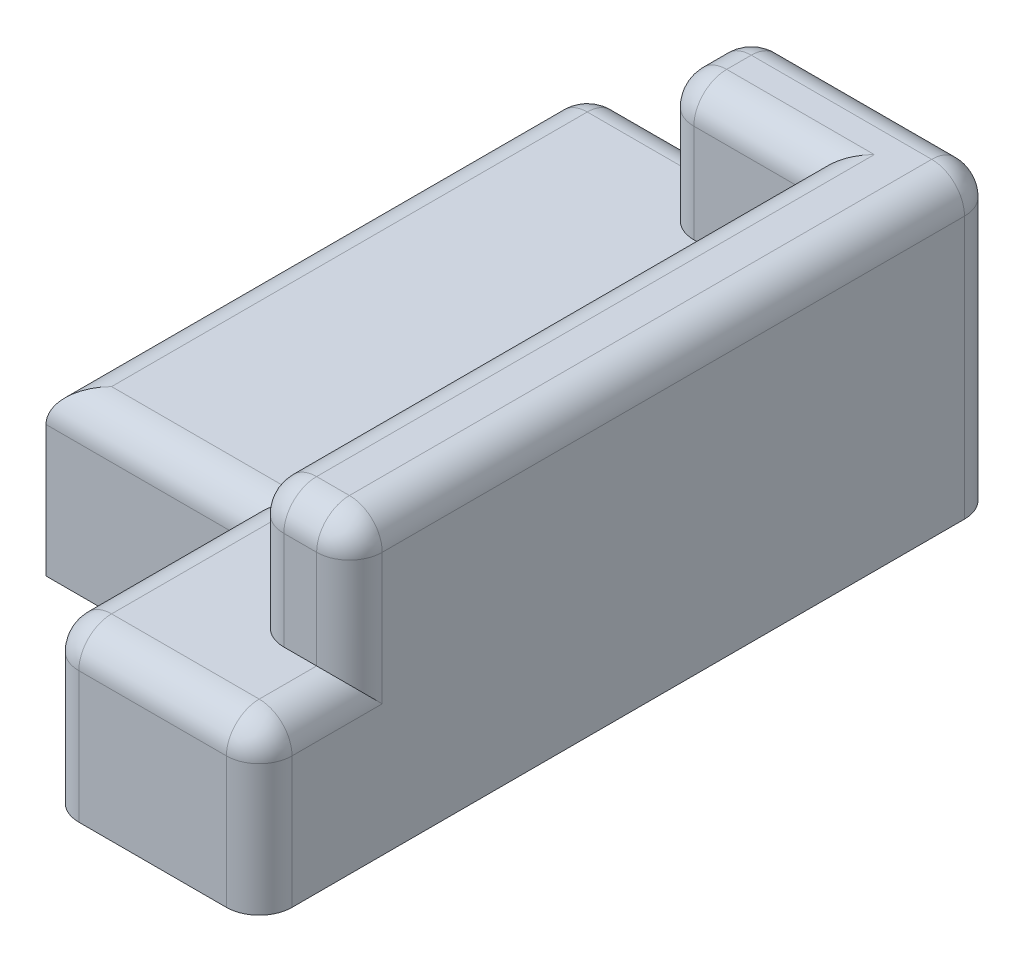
from build123d import *

# Parameters (mm, degrees)
ESBO_O1_W                      = 25
ESBO_O1_H                      = 45
RESSALTO_EXTRUS_O1_DEPTH       = 10
RESSALTO_EXTRUS_O2_DEPTH       = 28
ESBO_O3_W                      = 25
ESBO_O3_H                      = 45
RESSALTO_EXTRUS_O3_DEPTH       = 6
FURO_DE_DI_METRO_4_0_4_1_D     = 4
FURO_DE_DI_METRO_4_0_4_1_DEPTH = 5
FURO_DE_DI_METRO_4_0_4_1_TIP   = 1.201721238
ESBO_O7_W                      = 10
ESBO_O7_H                      = 28
CORTE_EXTRUS_O2_DEPTH          = 5.5
ESBO_O8_W                      = 12
ESBO_O8_H                      = 12
CORTE_EXTRUS_O3_DEPTH          = 12
CORTE_EXTRUS_O4_DEPTH          = 68.720011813
FILETE2_R                      = 2


with BuildPart() as part:
    # Esbo_o1 → Ressalto-extrus_o1 (new body)
    with BuildSketch(Plane(origin=(0, 0, 0), x_dir=(1, 0, 0), z_dir=(0, 1, 0))):
        with Locations((12.5, 22.5)):
            Rectangle(ESBO_O1_W, ESBO_O1_H)
    extrude(amount=RESSALTO_EXTRUS_O1_DEPTH)

    # Esbo_o2 → Ressalto-extrus_o2 (add)
    with BuildSketch(Plane(origin=(0, 10, 0), x_dir=(1, 0, 0), z_dir=(0, 1, 0))):
        Polygon((0, 39.5), (19, 39.5), (19, 5.5), (0, 5.5), (0, 0), (25, 0), (25, 39.5), (25, 45), (0, 45), align=None)
    extrude(amount=RESSALTO_EXTRUS_O2_DEPTH)

    # Esbo_o3 → Ressalto-extrus_o3 (add)
    with BuildSketch(Plane(origin=(0, 38, 0), x_dir=(1, 0, 0), z_dir=(0, 1, 0))):
        with Locations((12.5, 22.5)):
            Rectangle(ESBO_O3_W, ESBO_O3_H)
    extrude(amount=RESSALTO_EXTRUS_O3_DEPTH)

    # Furo de di_metro _4.0 _4_1
    with Locations(Plane(origin=(20, 0, -3), x_dir=(0, 0, -1), z_dir=(0, -1, 0))):
        with Locations((0, 0), (39, 0), (39, -15)):
            Hole(FURO_DE_DI_METRO_4_0_4_1_D / 2, depth=FURO_DE_DI_METRO_4_0_4_1_DEPTH)
            with Locations((0, 0, -(FURO_DE_DI_METRO_4_0_4_1_DEPTH + FURO_DE_DI_METRO_4_0_4_1_TIP / 2))):  # 118° drill point
                Cone(0, FURO_DE_DI_METRO_4_0_4_1_D / 2, FURO_DE_DI_METRO_4_0_4_1_TIP, mode=Mode.SUBTRACT)

    # Esbo_o7 → Corte-extrus_o2 (cut)
    with BuildSketch(Plane(origin=(0, 0, -45), x_dir=(-1, 0, 0), z_dir=(0, 0, -1))):
        with Locations((-5, 24)):
            Rectangle(ESBO_O7_W, ESBO_O7_H)
    extrude(amount=-CORTE_EXTRUS_O2_DEPTH, mode=Mode.SUBTRACT)

    # Esbo_o8 → Corte-extrus_o3 (cut)
    with BuildSketch(Plane.ZY):
        with Locations((-6, 6)):
            Rectangle(ESBO_O8_W, ESBO_O8_H)
    extrude(amount=-CORTE_EXTRUS_O3_DEPTH, mode=Mode.SUBTRACT)

    # Esbo_o9 → Corte-extrus_o4 (cut, through all)
    with BuildSketch(Plane.ZY):
        Polygon((-45, 44), (-45, 18), (-5.5, 18), (-5.5, 10), (0, 10), (0, 44), align=None)
    extrude(amount=-CORTE_EXTRUS_O4_DEPTH, mode=Mode.SUBTRACT)

    # Filete2
    filete2_edges = [part.edges().sort_by_distance(p)[0] for p in [
        (10, 14, -45),
        (10, 18, -42.25),
        (25, 9, -45),
        (25, 5, 0),
        (22, 18, -5.5),
        (19, 18, -22.5),
        (14.5, 18, -39.5),
        (25, 18, -25.25),
        (19, 14, -5.5),
        (25, 14, -5.5),
        (25, 10, -2.75),
        (18.5, 10, 0),
        (17.5, 18, -45),
        (0, 5, -45),
        (5, 10, -45),
        (10, 14, -39.5),
        (0, 10, -28.5),
        (6, 10, -12),
        (12, 5, 0),
        (12, 10, -6),
    ]]
    fillet(filete2_edges, radius=FILETE2_R)


solid = part.part
